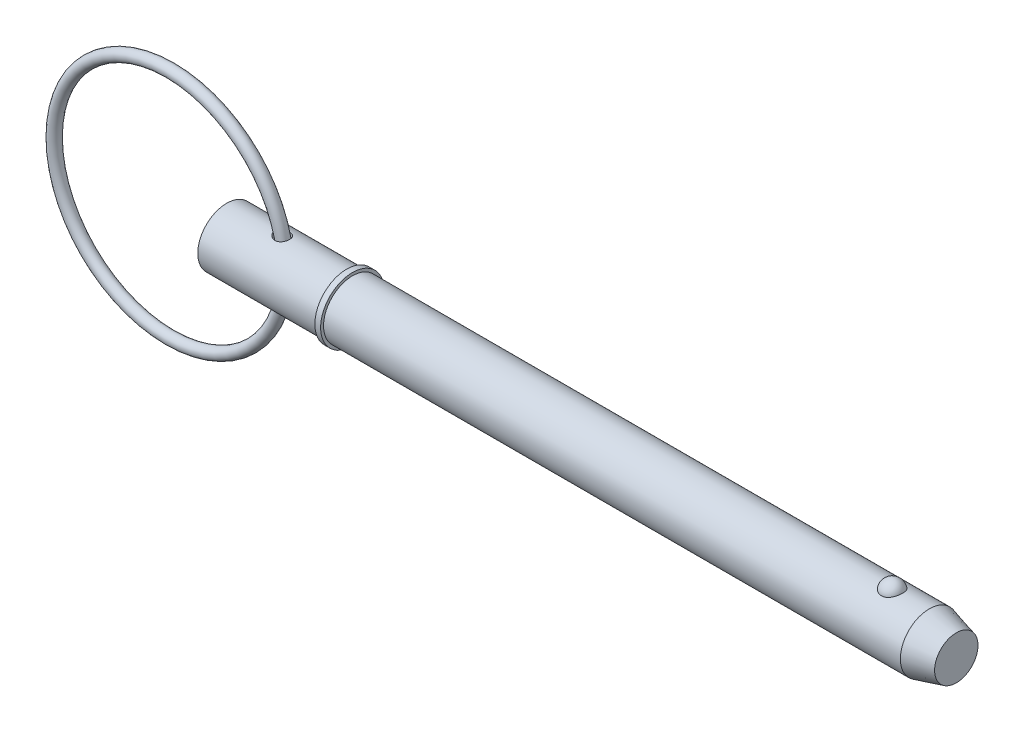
ISO-10303-21;
HEADER;
FILE_DESCRIPTION(('STEP AP214'),'2;1');
FILE_NAME('part.step','',(''),(''),'','','');
FILE_SCHEMA(('AUTOMOTIVE_DESIGN { 1 0 10303 214 1 1 1 1 }'));
ENDSEC;
DATA;
#1=APPLICATION_CONTEXT('core data for automotive mechanical design processes');
#2=APPLICATION_PROTOCOL_DEFINITION('international standard','automotive_design',2000,#1);
#3=PRODUCT_CONTEXT('',#1,'mechanical');
#4=PRODUCT('Part','Part','',(#3));
#5=PRODUCT_RELATED_PRODUCT_CATEGORY('part','',(#4));
#6=PRODUCT_DEFINITION_FORMATION('','',#4);
#7=PRODUCT_DEFINITION_CONTEXT('part definition',#1,'design');
#8=PRODUCT_DEFINITION('design','',#6,#7);
#9=PRODUCT_DEFINITION_SHAPE('','',#8);
#10=(LENGTH_UNIT() NAMED_UNIT(*) SI_UNIT(.MILLI.,.METRE.));
#11=(NAMED_UNIT(*) PLANE_ANGLE_UNIT() SI_UNIT($,.RADIAN.));
#12=(NAMED_UNIT(*) SI_UNIT($,.STERADIAN.) SOLID_ANGLE_UNIT());
#13=UNCERTAINTY_MEASURE_WITH_UNIT(LENGTH_MEASURE(1.E-05),#10,'distance_accuracy_value','');
#14=(GEOMETRIC_REPRESENTATION_CONTEXT(3) GLOBAL_UNCERTAINTY_ASSIGNED_CONTEXT((#13)) GLOBAL_UNIT_ASSIGNED_CONTEXT((#10,
#11,#12)) REPRESENTATION_CONTEXT('',''));
#15=CARTESIAN_POINT('',(0.,0.,0.));
#16=DIRECTION('',(0.,0.,1.));
#17=DIRECTION('',(1.,0.,0.));
#18=AXIS2_PLACEMENT_3D('',#15,#16,#17);
#19=CARTESIAN_POINT('',(-10.8860601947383,0.,0.));
#20=DIRECTION('',(0.,0.,1.));
#21=DIRECTION('',(1.,0.,0.));
#22=AXIS2_PLACEMENT_3D('',#19,#20,#21);
#23=TOROIDAL_SURFACE('',#22,22.225,1.111);
#24=CARTESIAN_POINT('',(12.4499398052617,0.,0.));
#25=VERTEX_POINT('',#24);
#26=VERTEX_LOOP('',#25);
#27=FACE_BOUND('',#26,.T.);
#28=ADVANCED_FACE('P0_F12',(#27),#23,.T.);
#29=CLOSED_SHELL('',(#28));
#30=MANIFOLD_SOLID_BREP('P0_B1',#29);
#31=CARTESIAN_POINT('',(0.,0.,0.));
#32=DIRECTION('',(1.,0.,0.));
#33=DIRECTION('',(0.,0.,-1.));
#34=AXIS2_PLACEMENT_3D('',#31,#32,#33);
#35=CYLINDRICAL_SURFACE('',#34,5.555);
#36=CARTESIAN_POINT('',(9.73108588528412,5.4531967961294,-1.05861687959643));
#37=CARTESIAN_POINT('',(9.79852417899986,5.4428857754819,-1.11173367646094));
#38=CARTESIAN_POINT('',(9.8705426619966,5.43287373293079,-1.15917228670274));
#39=CARTESIAN_POINT('',(10.0216706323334,5.41463354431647,-1.24159548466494));
#40=CARTESIAN_POINT('',(10.100788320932,5.40640749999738,-1.27656543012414));
#41=CARTESIAN_POINT('',(10.2640671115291,5.39277501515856,-1.33298568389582));
#42=CARTESIAN_POINT('',(10.3482338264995,5.38737178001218,-1.35442062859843));
#43=CARTESIAN_POINT('',(10.5191189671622,5.38018930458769,-1.38268153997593));
#44=CARTESIAN_POINT('',(10.6058357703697,5.37840780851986,-1.38951660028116));
#45=CARTESIAN_POINT('',(10.7759121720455,5.37883071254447,-1.38787777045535));
#46=CARTESIAN_POINT('',(10.8592768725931,5.38088957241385,-1.37996287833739));
#47=CARTESIAN_POINT('',(11.0231742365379,5.38856355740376,-1.34968531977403));
#48=CARTESIAN_POINT('',(11.1037078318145,5.39417750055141,-1.3273274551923));
#49=CARTESIAN_POINT('',(11.2542656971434,5.40784427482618,-1.27044672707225));
#50=CARTESIAN_POINT('',(11.3246325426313,5.41571997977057,-1.23678468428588));
#51=CARTESIAN_POINT('',(11.4584043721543,5.43310849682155,-1.15800564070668));
#52=CARTESIAN_POINT('',(11.5218100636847,5.44262114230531,-1.11288980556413));
#53=CARTESIAN_POINT('',(11.6387006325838,5.4619946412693,-1.01348173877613));
#54=CARTESIAN_POINT('',(11.6923567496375,5.47184490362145,-0.959388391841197));
#55=CARTESIAN_POINT('',(11.7899079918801,5.49098914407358,-0.842935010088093));
#56=CARTESIAN_POINT('',(11.8338027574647,5.5002831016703,-0.780574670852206));
#57=CARTESIAN_POINT('',(11.9111930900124,5.51740919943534,-0.648605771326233));
#58=CARTESIAN_POINT('',(11.944571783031,5.52522454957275,-0.578926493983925));
#59=CARTESIAN_POINT('',(11.9994972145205,5.5384271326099,-0.434834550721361));
#60=CARTESIAN_POINT('',(12.0210434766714,5.54381426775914,-0.360421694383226));
#61=CARTESIAN_POINT('',(12.0519313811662,5.55161917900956,-0.208311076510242));
#62=CARTESIAN_POINT('',(12.0611710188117,5.55401212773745,-0.130591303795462));
#63=CARTESIAN_POINT('',(12.0668974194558,5.55548938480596,0.025348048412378));
#64=CARTESIAN_POINT('',(12.0633840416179,5.55457365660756,0.103567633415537));
#65=CARTESIAN_POINT('',(12.0436796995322,5.54953010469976,0.258343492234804));
#66=CARTESIAN_POINT('',(12.0274798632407,5.54540003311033,0.334898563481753));
#67=CARTESIAN_POINT('',(11.9827711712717,5.53437033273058,0.484118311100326));
#68=CARTESIAN_POINT('',(11.9542620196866,5.52747063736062,0.556782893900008));
#69=CARTESIAN_POINT('',(11.8856108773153,5.51165296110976,0.696153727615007));
#70=CARTESIAN_POINT('',(11.8454690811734,5.50273501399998,0.762860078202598));
#71=CARTESIAN_POINT('',(11.7545317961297,5.48386724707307,0.888403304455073));
#72=CARTESIAN_POINT('',(11.7037367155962,5.47391746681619,0.94724048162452));
#73=CARTESIAN_POINT('',(11.5931044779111,5.45416351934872,1.05504470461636));
#74=CARTESIAN_POINT('',(11.533318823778,5.44435885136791,1.10406448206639));
#75=CARTESIAN_POINT('',(11.4061321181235,5.42595363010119,1.19123649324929));
#76=CARTESIAN_POINT('',(11.3387321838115,5.41735290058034,1.22939031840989));
#77=CARTESIAN_POINT('',(11.1991395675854,5.4024225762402,1.29341737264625));
#78=CARTESIAN_POINT('',(11.1270175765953,5.3960658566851,1.3194385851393));
#79=CARTESIAN_POINT('',(10.979323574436,5.38614405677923,1.35937634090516));
#80=CARTESIAN_POINT('',(10.9037515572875,5.38257898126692,1.37329286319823));
#81=CARTESIAN_POINT('',(10.7507722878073,5.37854282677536,1.38901730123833));
#82=CARTESIAN_POINT('',(10.6733560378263,5.37809300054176,1.39074204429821));
#83=CARTESIAN_POINT('',(10.5192388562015,5.38029043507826,1.38221411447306));
#84=CARTESIAN_POINT('',(10.4425381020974,5.38293844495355,1.37195854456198));
#85=CARTESIAN_POINT('',(10.2878936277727,5.39116673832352,1.33926960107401));
#86=CARTESIAN_POINT('',(10.2100819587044,5.3968880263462,1.31624874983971));
#87=CARTESIAN_POINT('',(10.0591420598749,5.4106466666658,1.25849276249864));
#88=CARTESIAN_POINT('',(9.98601576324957,5.41868496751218,1.22375282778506));
#89=CARTESIAN_POINT('',(9.84175565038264,5.43675805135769,1.14087469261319));
#90=CARTESIAN_POINT('',(9.77103801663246,5.44688674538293,1.09202994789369));
#91=CARTESIAN_POINT('',(9.63888287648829,5.46759592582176,0.983100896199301));
#92=CARTESIAN_POINT('',(9.57744762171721,5.47817652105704,0.923013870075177));
#93=CARTESIAN_POINT('',(9.4662044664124,5.49850106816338,0.792984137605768));
#94=CARTESIAN_POINT('',(9.4163677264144,5.5082470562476,0.723066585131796));
#95=CARTESIAN_POINT('',(9.33050546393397,5.52566389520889,0.574973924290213));
#96=CARTESIAN_POINT('',(9.29446727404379,5.53333664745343,0.496806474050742));
#97=CARTESIAN_POINT('',(9.24109888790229,5.54491199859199,0.342579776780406));
#98=CARTESIAN_POINT('',(9.22228936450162,5.54910883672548,0.26705568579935));
#99=CARTESIAN_POINT('',(9.19883437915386,5.55436306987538,0.113748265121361));
#100=CARTESIAN_POINT('',(9.19417820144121,5.55542284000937,0.0359666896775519));
#101=CARTESIAN_POINT('',(9.19905385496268,5.55432298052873,-0.111477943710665));
#102=CARTESIAN_POINT('',(9.20724428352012,5.55246769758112,-0.181191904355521));
#103=CARTESIAN_POINT('',(9.23493000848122,5.54630180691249,-0.318223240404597));
#104=CARTESIAN_POINT('',(9.25442702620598,5.54199082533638,-0.385540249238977));
#105=CARTESIAN_POINT('',(9.30387481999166,5.5313474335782,-0.516280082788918));
#106=CARTESIAN_POINT('',(9.33386163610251,5.52500806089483,-0.579688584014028));
#107=CARTESIAN_POINT('',(9.40305503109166,5.51092599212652,-0.701037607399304));
#108=CARTESIAN_POINT('',(9.44225922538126,5.50318365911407,-0.758979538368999));
#109=CARTESIAN_POINT('',(9.52133732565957,5.48833949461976,-0.859230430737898));
#110=CARTESIAN_POINT('',(9.55998996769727,5.48134889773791,-0.902529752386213));
#111=CARTESIAN_POINT('',(9.64209346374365,5.46725903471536,-0.984288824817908));
#112=CARTESIAN_POINT('',(9.68554534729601,5.46015974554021,-1.02274753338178));
#113=CARTESIAN_POINT('',(9.73108588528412,5.4531967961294,-1.05861687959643));
#114=B_SPLINE_CURVE_WITH_KNOTS('',3,(#36,#37,#38,#39,#40,#41,#42,#43,#44,#45,#46,#47,#48,#49,
#50,#51,#52,#53,#54,#55,#56,#57,#58,#59,#60,#61,#62,#63,#64,#65,#66,#67,#68,#69,#70,#71,#72,#73,
#74,#75,#76,#77,#78,#79,#80,#81,#82,#83,#84,#85,#86,#87,#88,#89,#90,#91,#92,#93,#94,#95,#96,#97,
#98,#99,#100,#101,#102,#103,#104,#105,#106,#107,#108,#109,#110,#111,#112,#113),.UNSPECIFIED.,
.T.,.F.,(4,2,2,2,2,2,2,2,2,2,2,2,2,2,2,2,2,2,2,2,2,2,2,2,2,2,2,2,2,2,2,2,2,2,2,2,2,2,4),(0.,
0.259176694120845,0.518656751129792,0.778430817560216,1.03804303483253,1.28801585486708,
1.53790560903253,1.77195750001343,2.00598558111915,2.23539047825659,2.4648038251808,
2.69668356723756,2.9285726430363,3.16237203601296,3.39617401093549,3.63013963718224,
3.86411088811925,4.09807822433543,4.33203659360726,4.56470246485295,4.79733424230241,
5.02704913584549,5.25676442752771,5.48804534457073,5.71938220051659,5.96237360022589,
6.20546461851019,6.46387943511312,6.72235683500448,6.98018450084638,7.23777490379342,
7.4702968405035,7.70264268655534,7.91229396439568,8.12197716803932,8.33238797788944,
8.54274441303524,8.71772674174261,8.89274668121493),.UNSPECIFIED.);
#115=CARTESIAN_POINT('',(9.73108588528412,5.4531967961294,-1.05861687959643));
#116=VERTEX_POINT('',#115);
#117=EDGE_CURVE('P1_E42',#116,#116,#114,.T.);
#118=ORIENTED_EDGE('',*,*,#117,.T.);
#119=EDGE_LOOP('',(#118));
#120=FACE_BOUND('',#119,.T.);
#121=CARTESIAN_POINT('',(0.,0.,0.));
#122=DIRECTION('',(1.,0.,0.));
#123=DIRECTION('',(0.,0.,-1.));
#124=AXIS2_PLACEMENT_3D('',#121,#122,#123);
#125=CIRCLE('',#124,5.555);
#126=CARTESIAN_POINT('',(0.,0.,-5.555));
#127=VERTEX_POINT('',#126);
#128=EDGE_CURVE('P1_E9',#127,#127,#125,.T.);
#129=ORIENTED_EDGE('',*,*,#128,.T.);
#130=EDGE_LOOP('',(#129));
#131=FACE_BOUND('',#130,.T.);
#132=CARTESIAN_POINT('',(23.019,0.,0.));
#133=DIRECTION('',(1.,0.,0.));
#134=DIRECTION('',(0.,0.,-1.));
#135=AXIS2_PLACEMENT_3D('',#132,#133,#134);
#136=CIRCLE('',#135,5.555);
#137=CARTESIAN_POINT('',(23.019,0.,-5.555));
#138=VERTEX_POINT('',#137);
#139=EDGE_CURVE('P1_E25',#138,#138,#136,.T.);
#140=ORIENTED_EDGE('',*,*,#139,.F.);
#141=EDGE_LOOP('',(#140));
#142=FACE_BOUND('',#141,.T.);
#143=CARTESIAN_POINT('',(9.73108588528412,-5.4531967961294,-1.05861687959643));
#144=CARTESIAN_POINT('',(9.66821110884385,-5.46281068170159,-1.00909184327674));
#145=CARTESIAN_POINT('',(9.60927221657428,-5.47269103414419,-0.954597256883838));
#146=CARTESIAN_POINT('',(9.50103698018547,-5.49196271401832,-0.836622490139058));
#147=CARTESIAN_POINT('',(9.45174193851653,-5.50135397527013,-0.773141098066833));
#148=CARTESIAN_POINT('',(9.36449982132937,-5.51864538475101,-0.638139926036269));
#149=CARTESIAN_POINT('',(9.32660692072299,-5.52653835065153,-0.566583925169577));
#150=CARTESIAN_POINT('',(9.26443740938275,-5.53978685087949,-0.417563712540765));
#151=CARTESIAN_POINT('',(9.24015003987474,-5.54514438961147,-0.34010422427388));
#152=CARTESIAN_POINT('',(9.20806696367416,-5.55228040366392,-0.188389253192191));
#153=CARTESIAN_POINT('',(9.19907227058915,-5.55431849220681,-0.114399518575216));
#154=CARTESIAN_POINT('',(9.19432225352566,-5.55539069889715,0.0340148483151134));
#155=CARTESIAN_POINT('',(9.19856204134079,-5.55442592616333,0.108439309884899));
#156=CARTESIAN_POINT('',(9.21926816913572,-5.54978420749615,0.250226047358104));
#157=CARTESIAN_POINT('',(9.2348766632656,-5.54629766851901,0.31772275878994));
#158=CARTESIAN_POINT('',(9.27656619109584,-5.53719805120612,0.449233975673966));
#159=CARTESIAN_POINT('',(9.3026486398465,-5.53158468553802,0.513248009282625));
#160=CARTESIAN_POINT('',(9.36540111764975,-5.51852259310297,0.63880901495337));
#161=CARTESIAN_POINT('',(9.40244578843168,-5.51101059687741,0.700161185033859));
#162=CARTESIAN_POINT('',(9.48531033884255,-5.49498546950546,0.816463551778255));
#163=CARTESIAN_POINT('',(9.5311337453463,-5.48647193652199,0.871411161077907));
#164=CARTESIAN_POINT('',(9.63549825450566,-5.46826315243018,0.979510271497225));
#165=CARTESIAN_POINT('',(9.69487291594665,-5.4585383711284,1.03185240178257));
#166=CARTESIAN_POINT('',(9.82107706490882,-5.43973797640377,1.12677509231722));
#167=CARTESIAN_POINT('',(9.8879103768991,-5.43066269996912,1.16935061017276));
#168=CARTESIAN_POINT('',(10.033391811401,-5.41336505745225,1.24708757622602));
#169=CARTESIAN_POINT('',(10.1125613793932,-5.40528106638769,1.28130933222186));
#170=CARTESIAN_POINT('',(10.2757060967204,-5.39196874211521,1.3362270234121));
#171=CARTESIAN_POINT('',(10.3596813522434,-5.38674047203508,1.35692265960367));
#172=CARTESIAN_POINT('',(10.5297702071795,-5.37991196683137,1.38375156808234));
#173=CARTESIAN_POINT('',(10.6158742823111,-5.37829778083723,1.38994084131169));
#174=CARTESIAN_POINT('',(10.7878226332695,-5.37901070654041,1.38718250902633));
#175=CARTESIAN_POINT('',(10.8736670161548,-5.38133587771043,1.37824235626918));
#176=CARTESIAN_POINT('',(11.0366214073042,-5.38945418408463,1.34612618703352));
#177=CARTESIAN_POINT('',(11.1139351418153,-5.39501006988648,1.32392147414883));
#178=CARTESIAN_POINT('',(11.2633246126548,-5.40877222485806,1.26652021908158));
#179=CARTESIAN_POINT('',(11.3354015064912,-5.41697790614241,1.23132655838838));
#180=CARTESIAN_POINT('',(11.4690899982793,-5.43466078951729,1.15069817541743));
#181=CARTESIAN_POINT('',(11.5310200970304,-5.4440673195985,1.10577441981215));
#182=CARTESIAN_POINT('',(11.6463540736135,-5.46335537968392,1.0061512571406));
#183=CARTESIAN_POINT('',(11.6997580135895,-5.47323690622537,0.951451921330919));
#184=CARTESIAN_POINT('',(11.7967319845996,-5.49239864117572,0.833747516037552));
#185=CARTESIAN_POINT('',(11.8402908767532,-5.50167816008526,0.770733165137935));
#186=CARTESIAN_POINT('',(11.9164538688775,-5.518621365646,0.638202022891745));
#187=CARTESIAN_POINT('',(11.9490573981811,-5.52628496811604,0.568684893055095));
#188=CARTESIAN_POINT('',(12.0028717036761,-5.53925911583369,0.424207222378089));
#189=CARTESIAN_POINT('',(12.023941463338,-5.54454040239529,0.349191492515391));
#190=CARTESIAN_POINT('',(12.053591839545,-5.55204602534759,0.196582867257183));
#191=CARTESIAN_POINT('',(12.0621722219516,-5.55427030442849,0.118989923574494));
#192=CARTESIAN_POINT('',(12.0666512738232,-5.55542602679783,-0.0368468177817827));
#193=CARTESIAN_POINT('',(12.0625074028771,-5.55434642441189,-0.11509192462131));
#194=CARTESIAN_POINT('',(12.0415418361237,-5.54898613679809,-0.269753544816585));
#195=CARTESIAN_POINT('',(12.0247199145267,-5.54470539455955,-0.346170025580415));
#196=CARTESIAN_POINT('',(11.9787920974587,-5.53340452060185,-0.495008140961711));
#197=CARTESIAN_POINT('',(11.9496857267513,-5.52638428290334,-0.56742962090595));
#198=CARTESIAN_POINT('',(11.8798787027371,-5.51036911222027,-0.706216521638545));
#199=CARTESIAN_POINT('',(11.8391779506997,-5.50137416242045,-0.772581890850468));
#200=CARTESIAN_POINT('',(11.7472553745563,-5.48242167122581,-0.897247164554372));
#201=CARTESIAN_POINT('',(11.6960515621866,-5.47246579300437,-0.955560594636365));
#202=CARTESIAN_POINT('',(11.5843994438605,-5.45270071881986,-1.06256643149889));
#203=CARTESIAN_POINT('',(11.5239521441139,-5.44289150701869,-1.11125988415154));
#204=CARTESIAN_POINT('',(11.396157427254,-5.42463941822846,-1.19717500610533));
#205=CARTESIAN_POINT('',(11.3288903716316,-5.41618309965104,-1.23451335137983));
#206=CARTESIAN_POINT('',(11.1888557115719,-5.40145691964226,-1.29743539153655));
#207=CARTESIAN_POINT('',(11.1160887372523,-5.39518680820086,-1.32302043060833));
#208=CARTESIAN_POINT('',(10.9677009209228,-5.38553131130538,-1.36179181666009));
#209=CARTESIAN_POINT('',(10.8921036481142,-5.38212602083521,-1.3750637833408));
#210=CARTESIAN_POINT('',(10.7396925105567,-5.37842027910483,-1.38948741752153));
#211=CARTESIAN_POINT('',(10.6628784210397,-5.37812040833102,-1.39063681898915));
#212=CARTESIAN_POINT('',(10.5077947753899,-5.38059635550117,-1.38102577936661));
#213=CARTESIAN_POINT('',(10.4295489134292,-5.3834629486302,-1.36991384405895));
#214=CARTESIAN_POINT('',(10.2758428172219,-5.3920092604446,-1.33587599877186));
#215=CARTESIAN_POINT('',(10.2003829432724,-5.39768934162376,-1.31294856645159));
#216=CARTESIAN_POINT('',(10.0559381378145,-5.4110281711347,-1.25682313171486));
#217=CARTESIAN_POINT('',(9.98683368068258,-5.41862962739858,-1.22391777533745));
#218=CARTESIAN_POINT('',(9.85432617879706,-5.43513913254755,-1.14838146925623));
#219=CARTESIAN_POINT('',(9.79092361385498,-5.44404729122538,-1.1057497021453));
#220=CARTESIAN_POINT('',(9.73108588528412,-5.4531967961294,-1.05861687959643));
#221=B_SPLINE_CURVE_WITH_KNOTS('',3,(#143,#144,#145,#146,#147,#148,#149,#150,#151,#152,#153,
#154,#155,#156,#157,#158,#159,#160,#161,#162,#163,#164,#165,#166,#167,#168,#169,#170,#171,#172,
#173,#174,#175,#176,#177,#178,#179,#180,#181,#182,#183,#184,#185,#186,#187,#188,#189,#190,#191,
#192,#193,#194,#195,#196,#197,#198,#199,#200,#201,#202,#203,#204,#205,#206,#207,#208,#209,#210,
#211,#212,#213,#214,#215,#216,#217,#218,#219,#220),.UNSPECIFIED.,.T.,.F.,(4,2,2,2,2,2,2,2,2,2,2,
2,2,2,2,2,2,2,2,2,2,2,2,2,2,2,2,2,2,2,2,2,2,2,2,2,2,2,4),(0.,0.241596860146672,
0.483226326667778,0.725986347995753,0.968554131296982,1.19103755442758,1.41343881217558,
1.62059806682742,1.82778531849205,2.04308674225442,2.25847484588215,2.4967195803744,
2.73508704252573,2.99374644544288,3.25241156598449,3.51007646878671,3.76761448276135,
4.00827541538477,4.24888299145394,4.47904430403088,4.70920393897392,4.93962269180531,
5.17005344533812,5.4032419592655,5.63643484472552,5.87040820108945,6.10438572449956,
6.33837230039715,6.57236086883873,6.80595147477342,7.03951667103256,7.27059385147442,
7.50164459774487,7.73107640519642,7.96055109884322,8.19677907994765,8.43303750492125,
8.66294515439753,8.89287213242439),.UNSPECIFIED.);
#222=CARTESIAN_POINT('',(9.73108588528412,-5.4531967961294,-1.05861687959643));
#223=VERTEX_POINT('',#222);
#224=EDGE_CURVE('P1_E17',#223,#223,#221,.T.);
#225=ORIENTED_EDGE('',*,*,#224,.T.);
#226=EDGE_LOOP('',(#225));
#227=FACE_BOUND('',#226,.T.);
#228=ADVANCED_FACE('P1_F13',(#120,#131,#142,#227),#35,.T.);
#229=CARTESIAN_POINT('',(0.,0.,0.));
#230=DIRECTION('',(1.,0.,0.));
#231=DIRECTION('',(0.,0.,-1.));
#232=AXIS2_PLACEMENT_3D('',#229,#230,#231);
#233=CYLINDRICAL_SURFACE('',#232,5.555);
#234=CARTESIAN_POINT('',(134.817114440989,0.,0.));
#235=DIRECTION('',(1.,0.,0.));
#236=DIRECTION('',(0.,0.,-1.));
#237=AXIS2_PLACEMENT_3D('',#234,#235,#236);
#238=CIRCLE('',#237,5.555);
#239=CARTESIAN_POINT('',(134.817114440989,0.,-5.555));
#240=VERTEX_POINT('',#239);
#241=EDGE_CURVE('P1_E99',#240,#240,#238,.T.);
#242=ORIENTED_EDGE('',*,*,#241,.F.);
#243=EDGE_LOOP('',(#242));
#244=FACE_BOUND('',#243,.T.);
#245=CARTESIAN_POINT('',(24.13,0.,0.));
#246=DIRECTION('',(1.,0.,0.));
#247=DIRECTION('',(0.,0.,-1.));
#248=AXIS2_PLACEMENT_3D('',#245,#246,#247);
#249=CIRCLE('',#248,5.555);
#250=CARTESIAN_POINT('',(24.13,0.,-5.555));
#251=VERTEX_POINT('',#250);
#252=EDGE_CURVE('P1_E96',#251,#251,#249,.T.);
#253=ORIENTED_EDGE('',*,*,#252,.T.);
#254=EDGE_LOOP('',(#253));
#255=FACE_BOUND('',#254,.T.);
#256=CARTESIAN_POINT('',(127.698626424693,5.16741224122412,2.03859650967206));
#257=CARTESIAN_POINT('',(127.592949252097,5.16740893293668,2.03859990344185));
#258=CARTESIAN_POINT('',(127.48729894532,5.17079470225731,2.03008306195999));
#259=CARTESIAN_POINT('',(127.279141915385,5.18392795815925,1.99630721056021));
#260=CARTESIAN_POINT('',(127.176634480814,5.19367399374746,1.97105201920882));
#261=CARTESIAN_POINT('',(126.977771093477,5.21839168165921,1.90463997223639));
#262=CARTESIAN_POINT('',(126.881406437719,5.23335573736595,1.8635062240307));
#263=CARTESIAN_POINT('',(126.697080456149,5.26688076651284,1.76652592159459));
#264=CARTESIAN_POINT('',(126.609120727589,5.28544242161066,1.71067657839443));
#265=CARTESIAN_POINT('',(126.441265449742,5.32479845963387,1.58399959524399));
#266=CARTESIAN_POINT('',(126.36166564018,5.34564089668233,1.51279545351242));
#267=CARTESIAN_POINT('',(126.21512901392,5.38697258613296,1.35828584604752));
#268=CARTESIAN_POINT('',(126.148194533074,5.40746177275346,1.27497815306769));
#269=CARTESIAN_POINT('',(126.02561039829,5.44694508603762,1.0944029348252));
#270=CARTESIAN_POINT('',(125.970598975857,5.46583143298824,0.996677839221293));
#271=CARTESIAN_POINT('',(125.876937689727,5.49908030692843,0.792961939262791));
#272=CARTESIAN_POINT('',(125.838289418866,5.513442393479,0.686970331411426));
#273=CARTESIAN_POINT('',(125.777680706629,5.53635851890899,0.468019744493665));
#274=CARTESIAN_POINT('',(125.755972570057,5.54482455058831,0.354981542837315));
#275=CARTESIAN_POINT('',(125.730636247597,5.55473324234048,0.126595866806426));
#276=CARTESIAN_POINT('',(125.727007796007,5.55617600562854,0.0112484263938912));
#277=CARTESIAN_POINT('',(125.737881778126,5.55189984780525,-0.218011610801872));
#278=CARTESIAN_POINT('',(125.752315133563,5.54620821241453,-0.331928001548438));
#279=CARTESIAN_POINT('',(125.798903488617,5.52828920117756,-0.555544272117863));
#280=CARTESIAN_POINT('',(125.831058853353,5.5160616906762,-0.665244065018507));
#281=CARTESIAN_POINT('',(125.912488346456,5.48630779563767,-0.877469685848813));
#282=CARTESIAN_POINT('',(125.961781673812,5.4687754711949,-0.979987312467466));
#283=CARTESIAN_POINT('',(126.076478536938,5.43024700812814,-1.17486975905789));
#284=CARTESIAN_POINT('',(126.141883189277,5.4092506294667,-1.26723387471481));
#285=CARTESIAN_POINT('',(126.287571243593,5.36600927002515,-1.4394013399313));
#286=CARTESIAN_POINT('',(126.367885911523,5.34376173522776,-1.51917763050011));
#287=CARTESIAN_POINT('',(126.541452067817,5.30057971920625,-1.66360338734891));
#288=CARTESIAN_POINT('',(126.634702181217,5.27964509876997,-1.72825445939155));
#289=CARTESIAN_POINT('',(126.829393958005,5.24205250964,-1.83909478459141));
#290=CARTESIAN_POINT('',(126.930590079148,5.22530519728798,-1.88568407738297));
#291=CARTESIAN_POINT('',(127.140155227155,5.1975091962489,-1.96100802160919));
#292=CARTESIAN_POINT('',(127.248521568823,5.1864583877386,-1.98974931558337));
#293=CARTESIAN_POINT('',(127.463498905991,5.17184410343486,-2.02742262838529));
#294=CARTESIAN_POINT('',(127.569925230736,5.1679328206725,-2.03727608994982));
#295=CARTESIAN_POINT('',(127.782992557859,5.16698995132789,-2.03966777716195));
#296=CARTESIAN_POINT('',(127.889633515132,5.16995704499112,-2.03220932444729));
#297=CARTESIAN_POINT('',(128.096773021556,5.18222383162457,-2.00071170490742));
#298=CARTESIAN_POINT('',(128.197359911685,5.19133213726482,-1.97717337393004));
#299=CARTESIAN_POINT('',(128.393014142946,5.21467637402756,-1.91475248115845));
#300=CARTESIAN_POINT('',(128.488081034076,5.22891272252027,-1.87586867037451));
#301=CARTESIAN_POINT('',(128.672371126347,5.26137066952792,-1.78282713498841));
#302=CARTESIAN_POINT('',(128.761419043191,5.27967329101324,-1.72835124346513));
#303=CARTESIAN_POINT('',(128.929288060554,5.3181741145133,-1.60597483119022));
#304=CARTESIAN_POINT('',(129.008106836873,5.33837274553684,-1.5380712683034));
#305=CARTESIAN_POINT('',(129.157515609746,5.37968287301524,-1.38688970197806));
#306=CARTESIAN_POINT('',(129.227505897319,5.40079011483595,-1.3030174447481));
#307=CARTESIAN_POINT('',(129.353012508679,5.44074401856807,-1.12458170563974));
#308=CARTESIAN_POINT('',(129.408526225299,5.45959027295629,-1.03001630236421));
#309=CARTESIAN_POINT('',(129.505550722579,5.49369849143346,-0.829439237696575));
#310=CARTESIAN_POINT('',(129.54654838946,5.50882422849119,-0.723155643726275));
#311=CARTESIAN_POINT('',(129.611125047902,5.53310911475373,-0.504772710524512));
#312=CARTESIAN_POINT('',(129.634703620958,5.54226812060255,-0.392673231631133));
#313=CARTESIAN_POINT('',(129.664013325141,5.55370358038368,-0.165459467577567));
#314=CARTESIAN_POINT('',(129.669688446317,5.55595843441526,-0.0503368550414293));
#315=CARTESIAN_POINT('',(129.662916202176,5.55329317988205,0.179288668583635));
#316=CARTESIAN_POINT('',(129.650469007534,5.54837313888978,0.293791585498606));
#317=CARTESIAN_POINT('',(129.607779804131,5.53189037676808,0.518526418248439));
#318=CARTESIAN_POINT('',(129.577598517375,5.5203503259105,0.628771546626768));
#319=CARTESIAN_POINT('',(129.500096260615,5.49182453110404,0.842318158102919));
#320=CARTESIAN_POINT('',(129.452774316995,5.47483847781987,0.945619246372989));
#321=CARTESIAN_POINT('',(129.341720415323,5.43710633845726,1.14281571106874));
#322=CARTESIAN_POINT('',(129.277921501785,5.41634501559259,1.23667048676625));
#323=CARTESIAN_POINT('',(129.135357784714,5.37334572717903,1.4118524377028));
#324=CARTESIAN_POINT('',(129.05659323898,5.35110778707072,1.49317982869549));
#325=CARTESIAN_POINT('',(128.886423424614,5.30779474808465,1.64049162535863));
#326=CARTESIAN_POINT('',(128.79510026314,5.28671324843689,1.7065687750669));
#327=CARTESIAN_POINT('',(128.601739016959,5.24804852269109,1.82201372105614));
#328=CARTESIAN_POINT('',(128.499700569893,5.23046541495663,1.87138095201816));
#329=CARTESIAN_POINT('',(128.283618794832,5.20042692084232,1.95335298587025));
#330=CARTESIAN_POINT('',(128.169260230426,5.18820192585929,1.98521734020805));
#331=CARTESIAN_POINT('',(127.936130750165,5.17169804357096,2.02783294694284));
#332=CARTESIAN_POINT('',(127.817361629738,5.16741595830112,2.03859269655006));
#333=CARTESIAN_POINT('',(127.698626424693,5.16741224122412,2.03859650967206));
#334=B_SPLINE_CURVE_WITH_KNOTS('',3,(#256,#257,#258,#259,#260,#261,#262,#263,#264,#265,#266,
#267,#268,#269,#270,#271,#272,#273,#274,#275,#276,#277,#278,#279,#280,#281,#282,#283,#284,#285,
#286,#287,#288,#289,#290,#291,#292,#293,#294,#295,#296,#297,#298,#299,#300,#301,#302,#303,#304,
#305,#306,#307,#308,#309,#310,#311,#312,#313,#314,#315,#316,#317,#318,#319,#320,#321,#322,#323,
#324,#325,#326,#327,#328,#329,#330,#331,#332,#333),.UNSPECIFIED.,.T.,.F.,(4,2,2,2,2,2,2,2,2,2,2,
2,2,2,2,2,2,2,2,2,2,2,2,2,2,2,2,2,2,2,2,2,2,2,2,2,2,2,4),(0.,0.316595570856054,
0.633118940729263,0.949183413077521,1.26530783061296,1.59030762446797,1.91536729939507,
2.25495824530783,2.59458224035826,2.93917283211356,3.28375835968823,3.62703002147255,
3.97030875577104,4.31397329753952,4.65766166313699,5.00207904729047,5.34645984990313,
5.68270547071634,6.01882587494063,6.33808403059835,6.65728093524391,6.9669637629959,
7.27667180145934,7.59321535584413,7.90983070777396,8.24210387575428,8.57443684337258,
8.91755896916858,9.26068933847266,9.604892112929,9.94909164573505,10.2921194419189,
10.6351667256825,10.9796305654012,11.3240884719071,11.6663928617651,12.0087088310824,
12.3645679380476,12.7202837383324),.UNSPECIFIED.);
#335=CARTESIAN_POINT('',(127.698626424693,5.16741224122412,2.03859650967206));
#336=VERTEX_POINT('',#335);
#337=EDGE_CURVE('P1_E34',#336,#336,#334,.T.);
#338=ORIENTED_EDGE('',*,*,#337,.T.);
#339=EDGE_LOOP('',(#338));
#340=FACE_BOUND('',#339,.T.);
#341=ADVANCED_FACE('P1_F46',(#244,#255,#340),#233,.T.);
#342=CARTESIAN_POINT('',(0.,0.,0.));
#343=DIRECTION('',(-1.,0.,0.));
#344=DIRECTION('',(0.,0.,1.));
#345=AXIS2_PLACEMENT_3D('',#342,#343,#344);
#346=PLANE('',#345);
#347=ORIENTED_EDGE('',*,*,#128,.F.);
#348=EDGE_LOOP('',(#347));
#349=FACE_BOUND('',#348,.T.);
#350=ADVANCED_FACE('P1_F15',(#349),#346,.T.);
#351=CARTESIAN_POINT('',(23.019,5.555,0.));
#352=DIRECTION('',(-1.,0.,0.));
#353=DIRECTION('',(0.,0.,1.));
#354=AXIS2_PLACEMENT_3D('',#351,#352,#353);
#355=PLANE('',#354);
#356=ORIENTED_EDGE('',*,*,#139,.T.);
#357=EDGE_LOOP('',(#356));
#358=FACE_BOUND('',#357,.T.);
#359=CARTESIAN_POINT('',(23.019,0.,0.));
#360=DIRECTION('',(1.,0.,0.));
#361=DIRECTION('',(0.,0.,-1.));
#362=AXIS2_PLACEMENT_3D('',#359,#360,#361);
#363=CIRCLE('',#362,6.1105);
#364=CARTESIAN_POINT('',(23.019,0.,-6.1105));
#365=VERTEX_POINT('',#364);
#366=EDGE_CURVE('P1_E30',#365,#365,#363,.T.);
#367=ORIENTED_EDGE('',*,*,#366,.F.);
#368=EDGE_LOOP('',(#367));
#369=FACE_BOUND('',#368,.T.);
#370=ADVANCED_FACE('P1_F81',(#358,#369),#355,.T.);
#371=CARTESIAN_POINT('',(0.,0.,0.));
#372=DIRECTION('',(1.,0.,0.));
#373=DIRECTION('',(0.,0.,-1.));
#374=AXIS2_PLACEMENT_3D('',#371,#372,#373);
#375=CYLINDRICAL_SURFACE('',#374,6.1105);
#376=ORIENTED_EDGE('',*,*,#366,.T.);
#377=EDGE_LOOP('',(#376));
#378=FACE_BOUND('',#377,.T.);
#379=CARTESIAN_POINT('',(24.13,0.,0.));
#380=DIRECTION('',(1.,0.,0.));
#381=DIRECTION('',(0.,0.,-1.));
#382=AXIS2_PLACEMENT_3D('',#379,#380,#381);
#383=CIRCLE('',#382,6.1105);
#384=CARTESIAN_POINT('',(24.13,0.,-6.1105));
#385=VERTEX_POINT('',#384);
#386=EDGE_CURVE('P1_E95',#385,#385,#383,.T.);
#387=ORIENTED_EDGE('',*,*,#386,.F.);
#388=EDGE_LOOP('',(#387));
#389=FACE_BOUND('',#388,.T.);
#390=ADVANCED_FACE('P1_F68',(#378,#389),#375,.T.);
#391=CARTESIAN_POINT('',(24.13,6.1105,0.));
#392=DIRECTION('',(1.,0.,0.));
#393=DIRECTION('',(0.,0.,-1.));
#394=AXIS2_PLACEMENT_3D('',#391,#392,#393);
#395=PLANE('',#394);
#396=ORIENTED_EDGE('',*,*,#386,.T.);
#397=EDGE_LOOP('',(#396));
#398=FACE_BOUND('',#397,.T.);
#399=ORIENTED_EDGE('',*,*,#252,.F.);
#400=EDGE_LOOP('',(#399));
#401=FACE_BOUND('',#400,.T.);
#402=ADVANCED_FACE('P1_F62',(#398,#401),#395,.T.);
#403=CARTESIAN_POINT('',(140.,0.,0.));
#404=DIRECTION('',(-1.,0.,0.));
#405=DIRECTION('',(0.,0.,1.));
#406=AXIS2_PLACEMENT_3D('',#403,#404,#405);
#407=CONICAL_SURFACE('',#406,4.16625000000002,0.261799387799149);
#408=ORIENTED_EDGE('',*,*,#241,.T.);
#409=EDGE_LOOP('',(#408));
#410=FACE_BOUND('',#409,.T.);
#411=CARTESIAN_POINT('',(140.,0.,0.));
#412=DIRECTION('',(1.,0.,0.));
#413=DIRECTION('',(0.,0.,-1.));
#414=AXIS2_PLACEMENT_3D('',#411,#412,#413);
#415=CIRCLE('',#414,4.16625000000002);
#416=CARTESIAN_POINT('',(140.,0.,-4.16625000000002));
#417=VERTEX_POINT('',#416);
#418=EDGE_CURVE('P1_E41',#417,#417,#415,.T.);
#419=ORIENTED_EDGE('',*,*,#418,.F.);
#420=EDGE_LOOP('',(#419));
#421=FACE_BOUND('',#420,.T.);
#422=ADVANCED_FACE('P1_F59',(#410,#421),#407,.T.);
#423=CARTESIAN_POINT('',(140.,4.16625000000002,0.));
#424=DIRECTION('',(1.,0.,0.));
#425=DIRECTION('',(0.,0.,-1.));
#426=AXIS2_PLACEMENT_3D('',#423,#424,#425);
#427=PLANE('',#426);
#428=ORIENTED_EDGE('',*,*,#418,.T.);
#429=EDGE_LOOP('',(#428));
#430=FACE_BOUND('',#429,.T.);
#431=ADVANCED_FACE('P1_F55',(#430),#427,.T.);
#432=CARTESIAN_POINT('',(127.698626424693,4.99949999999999,0.));
#433=DIRECTION('',(-1.,0.,0.));
#434=DIRECTION('',(0.,-1.,0.));
#435=AXIS2_PLACEMENT_3D('',#432,#433,#434);
#436=SPHERICAL_SURFACE('',#435,2.04550000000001);
#437=ORIENTED_EDGE('',*,*,#337,.F.);
#438=EDGE_LOOP('',(#437));
#439=FACE_BOUND('',#438,.T.);
#440=ADVANCED_FACE('P1_F50',(#439),#436,.T.);
#441=CARTESIAN_POINT('',(-10.8860601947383,0.,0.));
#442=DIRECTION('',(0.,0.,1.));
#443=DIRECTION('',(1.,0.,0.));
#444=AXIS2_PLACEMENT_3D('',#441,#442,#443);
#445=TOROIDAL_SURFACE('',#444,22.225,1.38875);
#446=ORIENTED_EDGE('',*,*,#224,.F.);
#447=EDGE_LOOP('',(#446));
#448=FACE_BOUND('',#447,.T.);
#449=ORIENTED_EDGE('',*,*,#117,.F.);
#450=EDGE_LOOP('',(#449));
#451=FACE_BOUND('',#450,.T.);
#452=ADVANCED_FACE('P1_F54',(#448,#451),#445,.F.);
#453=CLOSED_SHELL('',(#228,#341,#350,#370,#390,#402,#422,#431,#440,#452));
#454=MANIFOLD_SOLID_BREP('P1_B1',#453);
#455=ADVANCED_BREP_SHAPE_REPRESENTATION('',(#18,#30,#454),#14);
#456=SHAPE_DEFINITION_REPRESENTATION(#9,#455);
ENDSEC;
END-ISO-10303-21;
